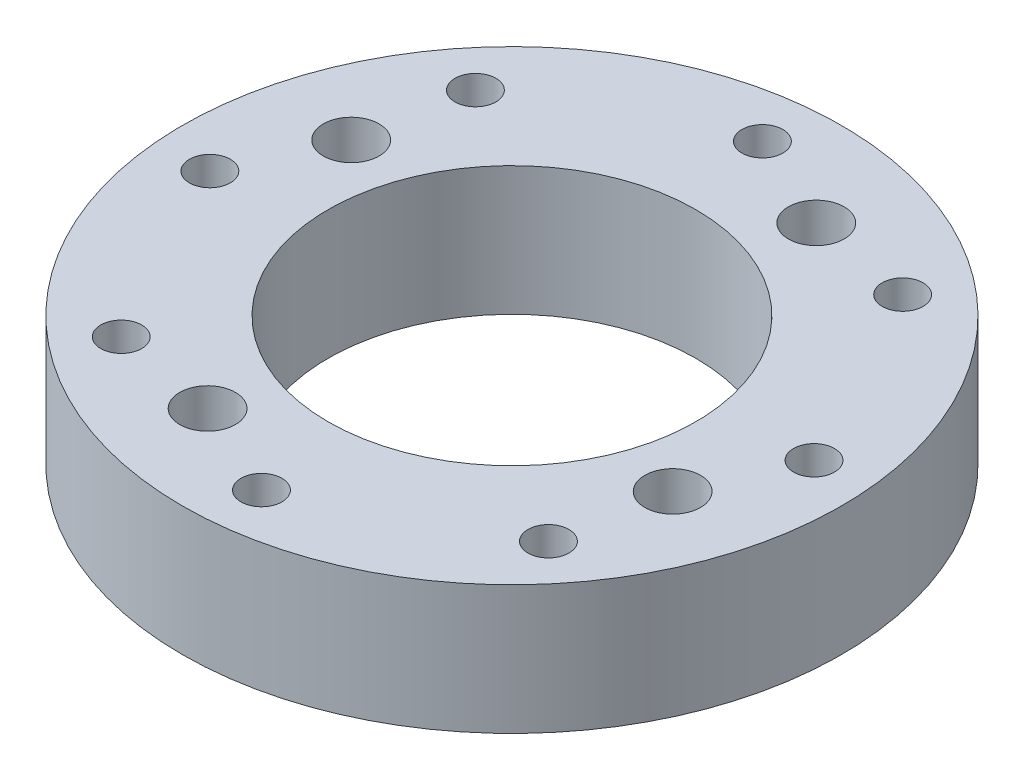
ISO-10303-21;
HEADER;
FILE_DESCRIPTION(('STEP AP214'),'2;1');
FILE_NAME('part.step','',(''),(''),'','','');
FILE_SCHEMA(('AUTOMOTIVE_DESIGN { 1 0 10303 214 1 1 1 1 }'));
ENDSEC;
DATA;
#1=APPLICATION_CONTEXT('core data for automotive mechanical design processes');
#2=APPLICATION_PROTOCOL_DEFINITION('international standard','automotive_design',2000,#1);
#3=PRODUCT_CONTEXT('',#1,'mechanical');
#4=PRODUCT('Part','Part','',(#3));
#5=PRODUCT_RELATED_PRODUCT_CATEGORY('part','',(#4));
#6=PRODUCT_DEFINITION_FORMATION('','',#4);
#7=PRODUCT_DEFINITION_CONTEXT('part definition',#1,'design');
#8=PRODUCT_DEFINITION('design','',#6,#7);
#9=PRODUCT_DEFINITION_SHAPE('','',#8);
#10=(LENGTH_UNIT() NAMED_UNIT(*) SI_UNIT(.MILLI.,.METRE.));
#11=(NAMED_UNIT(*) PLANE_ANGLE_UNIT() SI_UNIT($,.RADIAN.));
#12=(NAMED_UNIT(*) SI_UNIT($,.STERADIAN.) SOLID_ANGLE_UNIT());
#13=UNCERTAINTY_MEASURE_WITH_UNIT(LENGTH_MEASURE(1.E-05),#10,'distance_accuracy_value','');
#14=(GEOMETRIC_REPRESENTATION_CONTEXT(3) GLOBAL_UNCERTAINTY_ASSIGNED_CONTEXT((#13)) GLOBAL_UNIT_ASSIGNED_CONTEXT((#10,
#11,#12)) REPRESENTATION_CONTEXT('',''));
#15=CARTESIAN_POINT('',(0.,0.,0.));
#16=DIRECTION('',(0.,0.,1.));
#17=DIRECTION('',(1.,0.,0.));
#18=AXIS2_PLACEMENT_3D('',#15,#16,#17);
#19=CARTESIAN_POINT('',(0.,12.7,0.));
#20=DIRECTION('',(0.,1.,0.));
#21=DIRECTION('',(0.,0.,1.));
#22=AXIS2_PLACEMENT_3D('',#19,#20,#21);
#23=PLANE('',#22);
#24=CARTESIAN_POINT('',(21.0642430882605,12.7,17.4643657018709));
#25=DIRECTION('',(0.,-1.,0.));
#26=DIRECTION('',(0.,0.,-1.));
#27=AXIS2_PLACEMENT_3D('',#24,#25,#26);
#28=CIRCLE('',#27,2.0193);
#29=CARTESIAN_POINT('',(21.0642430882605,12.7,15.4450657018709));
#30=VERTEX_POINT('',#29);
#31=EDGE_CURVE('E142',#30,#30,#28,.T.);
#32=ORIENTED_EDGE('',*,*,#31,.T.);
#33=EDGE_LOOP('',(#32));
#34=FACE_BOUND('',#33,.T.);
#35=CARTESIAN_POINT('',(27.2438405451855,12.7,-2.54549771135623));
#36=DIRECTION('',(0.,-1.,0.));
#37=DIRECTION('',(0.,0.,-1.));
#38=AXIS2_PLACEMENT_3D('',#35,#36,#37);
#39=CIRCLE('',#38,2.0193);
#40=CARTESIAN_POINT('',(27.2438405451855,12.7,-4.56479771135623));
#41=VERTEX_POINT('',#40);
#42=EDGE_CURVE('E136',#41,#41,#39,.T.);
#43=ORIENTED_EDGE('',*,*,#42,.T.);
#44=EDGE_LOOP('',(#43));
#45=FACE_BOUND('',#44,.T.);
#46=CARTESIAN_POINT('',(17.4643657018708,12.7,-21.0642430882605));
#47=DIRECTION('',(0.,-1.,0.));
#48=DIRECTION('',(0.,0.,-1.));
#49=AXIS2_PLACEMENT_3D('',#46,#47,#48);
#50=CIRCLE('',#49,2.0193);
#51=CARTESIAN_POINT('',(17.4643657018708,12.7,-23.0835430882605));
#52=VERTEX_POINT('',#51);
#53=EDGE_CURVE('E130',#52,#52,#50,.T.);
#54=ORIENTED_EDGE('',*,*,#53,.T.);
#55=EDGE_LOOP('',(#54));
#56=FACE_BOUND('',#55,.T.);
#57=CARTESIAN_POINT('',(-2.54549771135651,12.7,-27.2438405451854));
#58=DIRECTION('',(0.,-1.,0.));
#59=DIRECTION('',(0.,0.,-1.));
#60=AXIS2_PLACEMENT_3D('',#57,#58,#59);
#61=CIRCLE('',#60,2.0193);
#62=CARTESIAN_POINT('',(-2.54549771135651,12.7,-29.2631405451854));
#63=VERTEX_POINT('',#62);
#64=EDGE_CURVE('E124',#63,#63,#61,.T.);
#65=ORIENTED_EDGE('',*,*,#64,.T.);
#66=EDGE_LOOP('',(#65));
#67=FACE_BOUND('',#66,.T.);
#68=CARTESIAN_POINT('',(-21.0642430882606,12.7,-17.4643657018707));
#69=DIRECTION('',(0.,-1.,0.));
#70=DIRECTION('',(0.,0.,-1.));
#71=AXIS2_PLACEMENT_3D('',#68,#69,#70);
#72=CIRCLE('',#71,2.0193);
#73=CARTESIAN_POINT('',(-21.0642430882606,12.7,-19.4836657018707));
#74=VERTEX_POINT('',#73);
#75=EDGE_CURVE('E118',#74,#74,#72,.T.);
#76=ORIENTED_EDGE('',*,*,#75,.T.);
#77=EDGE_LOOP('',(#76));
#78=FACE_BOUND('',#77,.T.);
#79=CARTESIAN_POINT('',(-27.2438405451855,12.7,2.54549771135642));
#80=DIRECTION('',(0.,-1.,0.));
#81=DIRECTION('',(0.,0.,-1.));
#82=AXIS2_PLACEMENT_3D('',#79,#80,#81);
#83=CIRCLE('',#82,2.0193);
#84=CARTESIAN_POINT('',(-27.2438405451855,12.7,0.526197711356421));
#85=VERTEX_POINT('',#84);
#86=EDGE_CURVE('E112',#85,#85,#83,.T.);
#87=ORIENTED_EDGE('',*,*,#86,.T.);
#88=EDGE_LOOP('',(#87));
#89=FACE_BOUND('',#88,.T.);
#90=CARTESIAN_POINT('',(-17.4643657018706,12.7,21.0642430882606));
#91=DIRECTION('',(0.,-1.,0.));
#92=DIRECTION('',(0.,0.,-1.));
#93=AXIS2_PLACEMENT_3D('',#90,#91,#92);
#94=CIRCLE('',#93,2.0193);
#95=CARTESIAN_POINT('',(-17.4643657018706,12.7,19.0449430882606));
#96=VERTEX_POINT('',#95);
#97=EDGE_CURVE('E106',#96,#96,#94,.T.);
#98=ORIENTED_EDGE('',*,*,#97,.T.);
#99=EDGE_LOOP('',(#98));
#100=FACE_BOUND('',#99,.T.);
#101=CARTESIAN_POINT('',(2.54549771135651,12.7,27.2438405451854));
#102=DIRECTION('',(0.,-1.,0.));
#103=DIRECTION('',(0.,0.,-1.));
#104=AXIS2_PLACEMENT_3D('',#101,#102,#103);
#105=CIRCLE('',#104,2.0193);
#106=CARTESIAN_POINT('',(2.54549771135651,12.7,25.2245405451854));
#107=VERTEX_POINT('',#106);
#108=EDGE_CURVE('E100',#107,#107,#105,.T.);
#109=ORIENTED_EDGE('',*,*,#108,.T.);
#110=EDGE_LOOP('',(#109));
#111=FACE_BOUND('',#110,.T.);
#112=CARTESIAN_POINT('',(22.9313664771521,12.7,7.08183814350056));
#113=DIRECTION('',(0.,-1.,0.));
#114=DIRECTION('',(0.,0.,-1.));
#115=AXIS2_PLACEMENT_3D('',#112,#113,#114);
#116=CIRCLE('',#115,2.75);
#117=CARTESIAN_POINT('',(22.9313664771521,12.7,4.33183814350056));
#118=VERTEX_POINT('',#117);
#119=EDGE_CURVE('E88',#118,#118,#116,.T.);
#120=ORIENTED_EDGE('',*,*,#119,.T.);
#121=EDGE_LOOP('',(#120));
#122=FACE_BOUND('',#121,.T.);
#123=CARTESIAN_POINT('',(7.08183814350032,12.7,-22.9313664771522));
#124=DIRECTION('',(0.,-1.,0.));
#125=DIRECTION('',(0.,0.,-1.));
#126=AXIS2_PLACEMENT_3D('',#123,#124,#125);
#127=CIRCLE('',#126,2.75);
#128=CARTESIAN_POINT('',(7.08183814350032,12.7,-25.6813664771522));
#129=VERTEX_POINT('',#128);
#130=EDGE_CURVE('E76',#129,#129,#127,.T.);
#131=ORIENTED_EDGE('',*,*,#130,.T.);
#132=EDGE_LOOP('',(#131));
#133=FACE_BOUND('',#132,.T.);
#134=CARTESIAN_POINT('',(-22.9313664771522,12.7,-7.0818381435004));
#135=DIRECTION('',(0.,-1.,0.));
#136=DIRECTION('',(0.,0.,-1.));
#137=AXIS2_PLACEMENT_3D('',#134,#135,#136);
#138=CIRCLE('',#137,2.75);
#139=CARTESIAN_POINT('',(-22.9313664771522,12.7,-9.83183814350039));
#140=VERTEX_POINT('',#139);
#141=EDGE_CURVE('E64',#140,#140,#138,.T.);
#142=ORIENTED_EDGE('',*,*,#141,.T.);
#143=EDGE_LOOP('',(#142));
#144=FACE_BOUND('',#143,.T.);
#145=CARTESIAN_POINT('',(-7.08183814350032,12.7,22.9313664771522));
#146=DIRECTION('',(0.,-1.,0.));
#147=DIRECTION('',(0.,0.,-1.));
#148=AXIS2_PLACEMENT_3D('',#145,#146,#147);
#149=CIRCLE('',#148,2.75);
#150=CARTESIAN_POINT('',(-7.08183814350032,12.7,20.1813664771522));
#151=VERTEX_POINT('',#150);
#152=EDGE_CURVE('E50',#151,#151,#149,.T.);
#153=ORIENTED_EDGE('',*,*,#152,.T.);
#154=EDGE_LOOP('',(#153));
#155=FACE_BOUND('',#154,.T.);
#156=CARTESIAN_POINT('',(0.,12.7,0.));
#157=DIRECTION('',(0.,1.,0.));
#158=DIRECTION('',(0.,0.,1.));
#159=AXIS2_PLACEMENT_3D('',#156,#157,#158);
#160=CIRCLE('',#159,32.5);
#161=CARTESIAN_POINT('',(0.,12.7,32.5));
#162=VERTEX_POINT('',#161);
#163=EDGE_CURVE('E10',#162,#162,#160,.T.);
#164=ORIENTED_EDGE('',*,*,#163,.T.);
#165=EDGE_LOOP('',(#164));
#166=FACE_BOUND('',#165,.T.);
#167=CARTESIAN_POINT('',(0.,12.7,0.));
#168=DIRECTION('',(0.,1.,0.));
#169=DIRECTION('',(0.,0.,1.));
#170=AXIS2_PLACEMENT_3D('',#167,#168,#169);
#171=CIRCLE('',#170,18.127);
#172=CARTESIAN_POINT('',(0.,12.7,18.127));
#173=VERTEX_POINT('',#172);
#174=EDGE_CURVE('E45',#173,#173,#171,.T.);
#175=ORIENTED_EDGE('',*,*,#174,.F.);
#176=EDGE_LOOP('',(#175));
#177=FACE_BOUND('',#176,.T.);
#178=ADVANCED_FACE('F34',(#34,#45,#56,#67,#78,#89,#100,#111,#122,#133,#144,#155,#166,#177),#23,.T.);
#179=CARTESIAN_POINT('',(0.,0.,0.));
#180=DIRECTION('',(0.,1.,0.));
#181=DIRECTION('',(0.,0.,1.));
#182=AXIS2_PLACEMENT_3D('',#179,#180,#181);
#183=PLANE('',#182);
#184=CARTESIAN_POINT('',(21.0642430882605,0.,17.4643657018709));
#185=DIRECTION('',(0.,-1.,0.));
#186=DIRECTION('',(0.,0.,-1.));
#187=AXIS2_PLACEMENT_3D('',#184,#185,#186);
#188=CIRCLE('',#187,2.01929999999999);
#189=CARTESIAN_POINT('',(21.0642430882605,0.,15.4450657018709));
#190=VERTEX_POINT('',#189);
#191=EDGE_CURVE('E145',#190,#190,#188,.T.);
#192=ORIENTED_EDGE('',*,*,#191,.F.);
#193=EDGE_LOOP('',(#192));
#194=FACE_BOUND('',#193,.T.);
#195=CARTESIAN_POINT('',(27.2438405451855,0.,-2.54549771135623));
#196=DIRECTION('',(0.,-1.,0.));
#197=DIRECTION('',(0.,0.,-1.));
#198=AXIS2_PLACEMENT_3D('',#195,#196,#197);
#199=CIRCLE('',#198,2.01929999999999);
#200=CARTESIAN_POINT('',(27.2438405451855,0.,-4.56479771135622));
#201=VERTEX_POINT('',#200);
#202=EDGE_CURVE('E139',#201,#201,#199,.T.);
#203=ORIENTED_EDGE('',*,*,#202,.F.);
#204=EDGE_LOOP('',(#203));
#205=FACE_BOUND('',#204,.T.);
#206=CARTESIAN_POINT('',(17.4643657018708,0.,-21.0642430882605));
#207=DIRECTION('',(0.,-1.,0.));
#208=DIRECTION('',(0.,0.,-1.));
#209=AXIS2_PLACEMENT_3D('',#206,#207,#208);
#210=CIRCLE('',#209,2.01929999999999);
#211=CARTESIAN_POINT('',(17.4643657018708,0.,-23.0835430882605));
#212=VERTEX_POINT('',#211);
#213=EDGE_CURVE('E133',#212,#212,#210,.T.);
#214=ORIENTED_EDGE('',*,*,#213,.F.);
#215=EDGE_LOOP('',(#214));
#216=FACE_BOUND('',#215,.T.);
#217=CARTESIAN_POINT('',(-2.54549771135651,0.,-27.2438405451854));
#218=DIRECTION('',(0.,-1.,0.));
#219=DIRECTION('',(0.,0.,-1.));
#220=AXIS2_PLACEMENT_3D('',#217,#218,#219);
#221=CIRCLE('',#220,2.01929999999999);
#222=CARTESIAN_POINT('',(-2.54549771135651,0.,-29.2631405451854));
#223=VERTEX_POINT('',#222);
#224=EDGE_CURVE('E127',#223,#223,#221,.T.);
#225=ORIENTED_EDGE('',*,*,#224,.F.);
#226=EDGE_LOOP('',(#225));
#227=FACE_BOUND('',#226,.T.);
#228=CARTESIAN_POINT('',(-21.0642430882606,0.,-17.4643657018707));
#229=DIRECTION('',(0.,-1.,0.));
#230=DIRECTION('',(0.,0.,-1.));
#231=AXIS2_PLACEMENT_3D('',#228,#229,#230);
#232=CIRCLE('',#231,2.01929999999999);
#233=CARTESIAN_POINT('',(-21.0642430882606,0.,-19.4836657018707));
#234=VERTEX_POINT('',#233);
#235=EDGE_CURVE('E121',#234,#234,#232,.T.);
#236=ORIENTED_EDGE('',*,*,#235,.F.);
#237=EDGE_LOOP('',(#236));
#238=FACE_BOUND('',#237,.T.);
#239=CARTESIAN_POINT('',(-27.2438405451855,0.,2.54549771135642));
#240=DIRECTION('',(0.,-1.,0.));
#241=DIRECTION('',(0.,0.,-1.));
#242=AXIS2_PLACEMENT_3D('',#239,#240,#241);
#243=CIRCLE('',#242,2.01929999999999);
#244=CARTESIAN_POINT('',(-27.2438405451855,0.,0.526197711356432));
#245=VERTEX_POINT('',#244);
#246=EDGE_CURVE('E115',#245,#245,#243,.T.);
#247=ORIENTED_EDGE('',*,*,#246,.F.);
#248=EDGE_LOOP('',(#247));
#249=FACE_BOUND('',#248,.T.);
#250=CARTESIAN_POINT('',(-17.4643657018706,0.,21.0642430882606));
#251=DIRECTION('',(0.,-1.,0.));
#252=DIRECTION('',(0.,0.,-1.));
#253=AXIS2_PLACEMENT_3D('',#250,#251,#252);
#254=CIRCLE('',#253,2.01929999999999);
#255=CARTESIAN_POINT('',(-17.4643657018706,0.,19.0449430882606));
#256=VERTEX_POINT('',#255);
#257=EDGE_CURVE('E109',#256,#256,#254,.T.);
#258=ORIENTED_EDGE('',*,*,#257,.F.);
#259=EDGE_LOOP('',(#258));
#260=FACE_BOUND('',#259,.T.);
#261=CARTESIAN_POINT('',(2.54549771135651,0.,27.2438405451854));
#262=DIRECTION('',(0.,-1.,0.));
#263=DIRECTION('',(0.,0.,-1.));
#264=AXIS2_PLACEMENT_3D('',#261,#262,#263);
#265=CIRCLE('',#264,2.01929999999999);
#266=CARTESIAN_POINT('',(2.54549771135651,0.,25.2245405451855));
#267=VERTEX_POINT('',#266);
#268=EDGE_CURVE('E103',#267,#267,#265,.T.);
#269=ORIENTED_EDGE('',*,*,#268,.F.);
#270=EDGE_LOOP('',(#269));
#271=FACE_BOUND('',#270,.T.);
#272=CARTESIAN_POINT('',(22.9313664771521,0.,7.08183814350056));
#273=DIRECTION('',(0.,-1.,0.));
#274=DIRECTION('',(0.,0.,-1.));
#275=AXIS2_PLACEMENT_3D('',#272,#273,#274);
#276=CIRCLE('',#275,5.);
#277=CARTESIAN_POINT('',(22.9313664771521,0.,2.08183814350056));
#278=VERTEX_POINT('',#277);
#279=EDGE_CURVE('E97',#278,#278,#276,.T.);
#280=ORIENTED_EDGE('',*,*,#279,.F.);
#281=EDGE_LOOP('',(#280));
#282=FACE_BOUND('',#281,.T.);
#283=CARTESIAN_POINT('',(7.08183814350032,0.,-22.9313664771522));
#284=DIRECTION('',(0.,-1.,0.));
#285=DIRECTION('',(0.,0.,-1.));
#286=AXIS2_PLACEMENT_3D('',#283,#284,#285);
#287=CIRCLE('',#286,5.);
#288=CARTESIAN_POINT('',(7.08183814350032,0.,-27.9313664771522));
#289=VERTEX_POINT('',#288);
#290=EDGE_CURVE('E85',#289,#289,#287,.T.);
#291=ORIENTED_EDGE('',*,*,#290,.F.);
#292=EDGE_LOOP('',(#291));
#293=FACE_BOUND('',#292,.T.);
#294=CARTESIAN_POINT('',(-22.9313664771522,0.,-7.0818381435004));
#295=DIRECTION('',(0.,-1.,0.));
#296=DIRECTION('',(0.,0.,-1.));
#297=AXIS2_PLACEMENT_3D('',#294,#295,#296);
#298=CIRCLE('',#297,5.);
#299=CARTESIAN_POINT('',(-22.9313664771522,0.,-12.0818381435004));
#300=VERTEX_POINT('',#299);
#301=EDGE_CURVE('E73',#300,#300,#298,.T.);
#302=ORIENTED_EDGE('',*,*,#301,.F.);
#303=EDGE_LOOP('',(#302));
#304=FACE_BOUND('',#303,.T.);
#305=CARTESIAN_POINT('',(-7.08183814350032,0.,22.9313664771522));
#306=DIRECTION('',(0.,-1.,0.));
#307=DIRECTION('',(0.,0.,-1.));
#308=AXIS2_PLACEMENT_3D('',#305,#306,#307);
#309=CIRCLE('',#308,5.);
#310=CARTESIAN_POINT('',(-7.08183814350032,0.,17.9313664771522));
#311=VERTEX_POINT('',#310);
#312=EDGE_CURVE('E61',#311,#311,#309,.T.);
#313=ORIENTED_EDGE('',*,*,#312,.F.);
#314=EDGE_LOOP('',(#313));
#315=FACE_BOUND('',#314,.T.);
#316=CARTESIAN_POINT('',(0.,0.,0.));
#317=DIRECTION('',(0.,1.,0.));
#318=DIRECTION('',(0.,0.,1.));
#319=AXIS2_PLACEMENT_3D('',#316,#317,#318);
#320=CIRCLE('',#319,32.5);
#321=CARTESIAN_POINT('',(0.,0.,32.5));
#322=VERTEX_POINT('',#321);
#323=EDGE_CURVE('E38',#322,#322,#320,.T.);
#324=ORIENTED_EDGE('',*,*,#323,.F.);
#325=EDGE_LOOP('',(#324));
#326=FACE_BOUND('',#325,.T.);
#327=CARTESIAN_POINT('',(0.,0.,0.));
#328=DIRECTION('',(0.,1.,0.));
#329=DIRECTION('',(0.,0.,1.));
#330=AXIS2_PLACEMENT_3D('',#327,#328,#329);
#331=CIRCLE('',#330,18.127);
#332=CARTESIAN_POINT('',(0.,0.,18.127));
#333=VERTEX_POINT('',#332);
#334=EDGE_CURVE('E47',#333,#333,#331,.T.);
#335=ORIENTED_EDGE('',*,*,#334,.T.);
#336=EDGE_LOOP('',(#335));
#337=FACE_BOUND('',#336,.T.);
#338=ADVANCED_FACE('F151',(#194,#205,#216,#227,#238,#249,#260,#271,#282,#293,#304,#315,#326,
#337),#183,.F.);
#339=CARTESIAN_POINT('',(0.,12.7,0.));
#340=DIRECTION('',(0.,-1.,0.));
#341=DIRECTION('',(0.,0.,-1.));
#342=AXIS2_PLACEMENT_3D('',#339,#340,#341);
#343=CYLINDRICAL_SURFACE('',#342,32.5);
#344=ORIENTED_EDGE('',*,*,#163,.F.);
#345=EDGE_LOOP('',(#344));
#346=FACE_BOUND('',#345,.T.);
#347=ORIENTED_EDGE('',*,*,#323,.T.);
#348=EDGE_LOOP('',(#347));
#349=FACE_BOUND('',#348,.T.);
#350=ADVANCED_FACE('F36',(#346,#349),#343,.T.);
#351=CARTESIAN_POINT('',(0.,12.7,0.));
#352=DIRECTION('',(0.,-1.,0.));
#353=DIRECTION('',(0.,0.,-1.));
#354=AXIS2_PLACEMENT_3D('',#351,#352,#353);
#355=CYLINDRICAL_SURFACE('',#354,18.127);
#356=ORIENTED_EDGE('',*,*,#174,.T.);
#357=EDGE_LOOP('',(#356));
#358=FACE_BOUND('',#357,.T.);
#359=ORIENTED_EDGE('',*,*,#334,.F.);
#360=EDGE_LOOP('',(#359));
#361=FACE_BOUND('',#360,.T.);
#362=ADVANCED_FACE('F180',(#358,#361),#355,.F.);
#363=CARTESIAN_POINT('',(-7.08183814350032,0.,22.9313664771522));
#364=DIRECTION('',(0.,-1.,0.));
#365=DIRECTION('',(0.,0.,-1.));
#366=AXIS2_PLACEMENT_3D('',#363,#364,#365);
#367=CYLINDRICAL_SURFACE('',#366,2.75);
#368=ORIENTED_EDGE('',*,*,#152,.F.);
#369=EDGE_LOOP('',(#368));
#370=FACE_BOUND('',#369,.T.);
#371=CARTESIAN_POINT('',(-7.08183814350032,6.778,22.9313664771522));
#372=DIRECTION('',(0.,-1.,0.));
#373=DIRECTION('',(0.,0.,-1.));
#374=AXIS2_PLACEMENT_3D('',#371,#372,#373);
#375=CIRCLE('',#374,2.75);
#376=CARTESIAN_POINT('',(-7.08183814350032,6.778,20.1813664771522));
#377=VERTEX_POINT('',#376);
#378=EDGE_CURVE('E55',#377,#377,#375,.T.);
#379=ORIENTED_EDGE('',*,*,#378,.T.);
#380=EDGE_LOOP('',(#379));
#381=FACE_BOUND('',#380,.T.);
#382=ADVANCED_FACE('F182',(#370,#381),#367,.F.);
#383=CARTESIAN_POINT('',(-4.33183814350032,6.778,22.9313664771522));
#384=DIRECTION('',(0.,1.,0.));
#385=DIRECTION('',(0.,0.,1.));
#386=AXIS2_PLACEMENT_3D('',#383,#384,#385);
#387=PLANE('',#386);
#388=ORIENTED_EDGE('',*,*,#378,.F.);
#389=EDGE_LOOP('',(#388));
#390=FACE_BOUND('',#389,.T.);
#391=CARTESIAN_POINT('',(-7.08183814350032,6.778,22.9313664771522));
#392=DIRECTION('',(0.,-1.,0.));
#393=DIRECTION('',(0.,0.,-1.));
#394=AXIS2_PLACEMENT_3D('',#391,#392,#393);
#395=CIRCLE('',#394,5.);
#396=CARTESIAN_POINT('',(-7.08183814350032,6.778,17.9313664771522));
#397=VERTEX_POINT('',#396);
#398=EDGE_CURVE('E58',#397,#397,#395,.T.);
#399=ORIENTED_EDGE('',*,*,#398,.T.);
#400=EDGE_LOOP('',(#399));
#401=FACE_BOUND('',#400,.T.);
#402=ADVANCED_FACE('F189',(#390,#401),#387,.F.);
#403=CARTESIAN_POINT('',(-7.08183814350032,0.,22.9313664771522));
#404=DIRECTION('',(0.,-1.,0.));
#405=DIRECTION('',(0.,0.,-1.));
#406=AXIS2_PLACEMENT_3D('',#403,#404,#405);
#407=CYLINDRICAL_SURFACE('',#406,5.);
#408=ORIENTED_EDGE('',*,*,#398,.F.);
#409=EDGE_LOOP('',(#408));
#410=FACE_BOUND('',#409,.T.);
#411=ORIENTED_EDGE('',*,*,#312,.T.);
#412=EDGE_LOOP('',(#411));
#413=FACE_BOUND('',#412,.T.);
#414=ADVANCED_FACE('F228',(#410,#413),#407,.F.);
#415=CARTESIAN_POINT('',(-22.9313664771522,0.,-7.0818381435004));
#416=DIRECTION('',(0.,-1.,0.));
#417=DIRECTION('',(0.,0.,-1.));
#418=AXIS2_PLACEMENT_3D('',#415,#416,#417);
#419=CYLINDRICAL_SURFACE('',#418,2.75);
#420=ORIENTED_EDGE('',*,*,#141,.F.);
#421=EDGE_LOOP('',(#420));
#422=FACE_BOUND('',#421,.T.);
#423=CARTESIAN_POINT('',(-22.9313664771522,6.778,-7.0818381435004));
#424=DIRECTION('',(0.,-1.,0.));
#425=DIRECTION('',(0.,0.,-1.));
#426=AXIS2_PLACEMENT_3D('',#423,#424,#425);
#427=CIRCLE('',#426,2.75);
#428=CARTESIAN_POINT('',(-22.9313664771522,6.778,-9.83183814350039));
#429=VERTEX_POINT('',#428);
#430=EDGE_CURVE('E67',#429,#429,#427,.T.);
#431=ORIENTED_EDGE('',*,*,#430,.T.);
#432=EDGE_LOOP('',(#431));
#433=FACE_BOUND('',#432,.T.);
#434=ADVANCED_FACE('F234',(#422,#433),#419,.F.);
#435=CARTESIAN_POINT('',(-20.1813664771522,6.778,-7.0818381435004));
#436=DIRECTION('',(0.,1.,0.));
#437=DIRECTION('',(0.,0.,1.));
#438=AXIS2_PLACEMENT_3D('',#435,#436,#437);
#439=PLANE('',#438);
#440=ORIENTED_EDGE('',*,*,#430,.F.);
#441=EDGE_LOOP('',(#440));
#442=FACE_BOUND('',#441,.T.);
#443=CARTESIAN_POINT('',(-22.9313664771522,6.778,-7.0818381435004));
#444=DIRECTION('',(0.,-1.,0.));
#445=DIRECTION('',(0.,0.,-1.));
#446=AXIS2_PLACEMENT_3D('',#443,#444,#445);
#447=CIRCLE('',#446,5.);
#448=CARTESIAN_POINT('',(-22.9313664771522,6.778,-12.0818381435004));
#449=VERTEX_POINT('',#448);
#450=EDGE_CURVE('E70',#449,#449,#447,.T.);
#451=ORIENTED_EDGE('',*,*,#450,.T.);
#452=EDGE_LOOP('',(#451));
#453=FACE_BOUND('',#452,.T.);
#454=ADVANCED_FACE('F239',(#442,#453),#439,.F.);
#455=CARTESIAN_POINT('',(-22.9313664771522,0.,-7.0818381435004));
#456=DIRECTION('',(0.,-1.,0.));
#457=DIRECTION('',(0.,0.,-1.));
#458=AXIS2_PLACEMENT_3D('',#455,#456,#457);
#459=CYLINDRICAL_SURFACE('',#458,5.);
#460=ORIENTED_EDGE('',*,*,#450,.F.);
#461=EDGE_LOOP('',(#460));
#462=FACE_BOUND('',#461,.T.);
#463=ORIENTED_EDGE('',*,*,#301,.T.);
#464=EDGE_LOOP('',(#463));
#465=FACE_BOUND('',#464,.T.);
#466=ADVANCED_FACE('F245',(#462,#465),#459,.F.);
#467=CARTESIAN_POINT('',(7.08183814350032,0.,-22.9313664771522));
#468=DIRECTION('',(0.,-1.,0.));
#469=DIRECTION('',(0.,0.,-1.));
#470=AXIS2_PLACEMENT_3D('',#467,#468,#469);
#471=CYLINDRICAL_SURFACE('',#470,2.75);
#472=ORIENTED_EDGE('',*,*,#130,.F.);
#473=EDGE_LOOP('',(#472));
#474=FACE_BOUND('',#473,.T.);
#475=CARTESIAN_POINT('',(7.08183814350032,6.778,-22.9313664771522));
#476=DIRECTION('',(0.,-1.,0.));
#477=DIRECTION('',(0.,0.,-1.));
#478=AXIS2_PLACEMENT_3D('',#475,#476,#477);
#479=CIRCLE('',#478,2.75);
#480=CARTESIAN_POINT('',(7.08183814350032,6.778,-25.6813664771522));
#481=VERTEX_POINT('',#480);
#482=EDGE_CURVE('E79',#481,#481,#479,.T.);
#483=ORIENTED_EDGE('',*,*,#482,.T.);
#484=EDGE_LOOP('',(#483));
#485=FACE_BOUND('',#484,.T.);
#486=ADVANCED_FACE('F249',(#474,#485),#471,.F.);
#487=CARTESIAN_POINT('',(9.83183814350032,6.778,-22.9313664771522));
#488=DIRECTION('',(0.,1.,0.));
#489=DIRECTION('',(0.,0.,1.));
#490=AXIS2_PLACEMENT_3D('',#487,#488,#489);
#491=PLANE('',#490);
#492=ORIENTED_EDGE('',*,*,#482,.F.);
#493=EDGE_LOOP('',(#492));
#494=FACE_BOUND('',#493,.T.);
#495=CARTESIAN_POINT('',(7.08183814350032,6.778,-22.9313664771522));
#496=DIRECTION('',(0.,-1.,0.));
#497=DIRECTION('',(0.,0.,-1.));
#498=AXIS2_PLACEMENT_3D('',#495,#496,#497);
#499=CIRCLE('',#498,5.);
#500=CARTESIAN_POINT('',(7.08183814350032,6.778,-27.9313664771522));
#501=VERTEX_POINT('',#500);
#502=EDGE_CURVE('E82',#501,#501,#499,.T.);
#503=ORIENTED_EDGE('',*,*,#502,.T.);
#504=EDGE_LOOP('',(#503));
#505=FACE_BOUND('',#504,.T.);
#506=ADVANCED_FACE('F253',(#494,#505),#491,.F.);
#507=CARTESIAN_POINT('',(7.08183814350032,0.,-22.9313664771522));
#508=DIRECTION('',(0.,-1.,0.));
#509=DIRECTION('',(0.,0.,-1.));
#510=AXIS2_PLACEMENT_3D('',#507,#508,#509);
#511=CYLINDRICAL_SURFACE('',#510,5.);
#512=ORIENTED_EDGE('',*,*,#502,.F.);
#513=EDGE_LOOP('',(#512));
#514=FACE_BOUND('',#513,.T.);
#515=ORIENTED_EDGE('',*,*,#290,.T.);
#516=EDGE_LOOP('',(#515));
#517=FACE_BOUND('',#516,.T.);
#518=ADVANCED_FACE('F257',(#514,#517),#511,.F.);
#519=CARTESIAN_POINT('',(22.9313664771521,0.,7.08183814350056));
#520=DIRECTION('',(0.,-1.,0.));
#521=DIRECTION('',(0.,0.,-1.));
#522=AXIS2_PLACEMENT_3D('',#519,#520,#521);
#523=CYLINDRICAL_SURFACE('',#522,2.75);
#524=ORIENTED_EDGE('',*,*,#119,.F.);
#525=EDGE_LOOP('',(#524));
#526=FACE_BOUND('',#525,.T.);
#527=CARTESIAN_POINT('',(22.9313664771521,6.778,7.08183814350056));
#528=DIRECTION('',(0.,-1.,0.));
#529=DIRECTION('',(0.,0.,-1.));
#530=AXIS2_PLACEMENT_3D('',#527,#528,#529);
#531=CIRCLE('',#530,2.75);
#532=CARTESIAN_POINT('',(22.9313664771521,6.778,4.33183814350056));
#533=VERTEX_POINT('',#532);
#534=EDGE_CURVE('E91',#533,#533,#531,.T.);
#535=ORIENTED_EDGE('',*,*,#534,.T.);
#536=EDGE_LOOP('',(#535));
#537=FACE_BOUND('',#536,.T.);
#538=ADVANCED_FACE('F261',(#526,#537),#523,.F.);
#539=CARTESIAN_POINT('',(25.6813664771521,6.778,7.08183814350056));
#540=DIRECTION('',(0.,1.,0.));
#541=DIRECTION('',(0.,0.,1.));
#542=AXIS2_PLACEMENT_3D('',#539,#540,#541);
#543=PLANE('',#542);
#544=ORIENTED_EDGE('',*,*,#534,.F.);
#545=EDGE_LOOP('',(#544));
#546=FACE_BOUND('',#545,.T.);
#547=CARTESIAN_POINT('',(22.9313664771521,6.778,7.08183814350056));
#548=DIRECTION('',(0.,-1.,0.));
#549=DIRECTION('',(0.,0.,-1.));
#550=AXIS2_PLACEMENT_3D('',#547,#548,#549);
#551=CIRCLE('',#550,5.);
#552=CARTESIAN_POINT('',(22.9313664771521,6.778,2.08183814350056));
#553=VERTEX_POINT('',#552);
#554=EDGE_CURVE('E94',#553,#553,#551,.T.);
#555=ORIENTED_EDGE('',*,*,#554,.T.);
#556=EDGE_LOOP('',(#555));
#557=FACE_BOUND('',#556,.T.);
#558=ADVANCED_FACE('F265',(#546,#557),#543,.F.);
#559=CARTESIAN_POINT('',(22.9313664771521,0.,7.08183814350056));
#560=DIRECTION('',(0.,-1.,0.));
#561=DIRECTION('',(0.,0.,-1.));
#562=AXIS2_PLACEMENT_3D('',#559,#560,#561);
#563=CYLINDRICAL_SURFACE('',#562,5.);
#564=ORIENTED_EDGE('',*,*,#554,.F.);
#565=EDGE_LOOP('',(#564));
#566=FACE_BOUND('',#565,.T.);
#567=ORIENTED_EDGE('',*,*,#279,.T.);
#568=EDGE_LOOP('',(#567));
#569=FACE_BOUND('',#568,.T.);
#570=ADVANCED_FACE('F269',(#566,#569),#563,.F.);
#571=CARTESIAN_POINT('',(2.54549771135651,0.,27.2438405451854));
#572=DIRECTION('',(0.,-1.,0.));
#573=DIRECTION('',(0.,0.,-1.));
#574=AXIS2_PLACEMENT_3D('',#571,#572,#573);
#575=CYLINDRICAL_SURFACE('',#574,2.01929999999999);
#576=ORIENTED_EDGE('',*,*,#108,.F.);
#577=EDGE_LOOP('',(#576));
#578=FACE_BOUND('',#577,.T.);
#579=ORIENTED_EDGE('',*,*,#268,.T.);
#580=EDGE_LOOP('',(#579));
#581=FACE_BOUND('',#580,.T.);
#582=ADVANCED_FACE('F273',(#578,#581),#575,.F.);
#583=CARTESIAN_POINT('',(-17.4643657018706,0.,21.0642430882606));
#584=DIRECTION('',(0.,-1.,0.));
#585=DIRECTION('',(0.,0.,-1.));
#586=AXIS2_PLACEMENT_3D('',#583,#584,#585);
#587=CYLINDRICAL_SURFACE('',#586,2.01929999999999);
#588=ORIENTED_EDGE('',*,*,#97,.F.);
#589=EDGE_LOOP('',(#588));
#590=FACE_BOUND('',#589,.T.);
#591=ORIENTED_EDGE('',*,*,#257,.T.);
#592=EDGE_LOOP('',(#591));
#593=FACE_BOUND('',#592,.T.);
#594=ADVANCED_FACE('F277',(#590,#593),#587,.F.);
#595=CARTESIAN_POINT('',(-27.2438405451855,0.,2.54549771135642));
#596=DIRECTION('',(0.,-1.,0.));
#597=DIRECTION('',(0.,0.,-1.));
#598=AXIS2_PLACEMENT_3D('',#595,#596,#597);
#599=CYLINDRICAL_SURFACE('',#598,2.01929999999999);
#600=ORIENTED_EDGE('',*,*,#86,.F.);
#601=EDGE_LOOP('',(#600));
#602=FACE_BOUND('',#601,.T.);
#603=ORIENTED_EDGE('',*,*,#246,.T.);
#604=EDGE_LOOP('',(#603));
#605=FACE_BOUND('',#604,.T.);
#606=ADVANCED_FACE('F281',(#602,#605),#599,.F.);
#607=CARTESIAN_POINT('',(-21.0642430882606,0.,-17.4643657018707));
#608=DIRECTION('',(0.,-1.,0.));
#609=DIRECTION('',(0.,0.,-1.));
#610=AXIS2_PLACEMENT_3D('',#607,#608,#609);
#611=CYLINDRICAL_SURFACE('',#610,2.01929999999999);
#612=ORIENTED_EDGE('',*,*,#75,.F.);
#613=EDGE_LOOP('',(#612));
#614=FACE_BOUND('',#613,.T.);
#615=ORIENTED_EDGE('',*,*,#235,.T.);
#616=EDGE_LOOP('',(#615));
#617=FACE_BOUND('',#616,.T.);
#618=ADVANCED_FACE('F285',(#614,#617),#611,.F.);
#619=CARTESIAN_POINT('',(-2.54549771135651,0.,-27.2438405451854));
#620=DIRECTION('',(0.,-1.,0.));
#621=DIRECTION('',(0.,0.,-1.));
#622=AXIS2_PLACEMENT_3D('',#619,#620,#621);
#623=CYLINDRICAL_SURFACE('',#622,2.01929999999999);
#624=ORIENTED_EDGE('',*,*,#64,.F.);
#625=EDGE_LOOP('',(#624));
#626=FACE_BOUND('',#625,.T.);
#627=ORIENTED_EDGE('',*,*,#224,.T.);
#628=EDGE_LOOP('',(#627));
#629=FACE_BOUND('',#628,.T.);
#630=ADVANCED_FACE('F289',(#626,#629),#623,.F.);
#631=CARTESIAN_POINT('',(17.4643657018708,0.,-21.0642430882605));
#632=DIRECTION('',(0.,-1.,0.));
#633=DIRECTION('',(0.,0.,-1.));
#634=AXIS2_PLACEMENT_3D('',#631,#632,#633);
#635=CYLINDRICAL_SURFACE('',#634,2.01929999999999);
#636=ORIENTED_EDGE('',*,*,#53,.F.);
#637=EDGE_LOOP('',(#636));
#638=FACE_BOUND('',#637,.T.);
#639=ORIENTED_EDGE('',*,*,#213,.T.);
#640=EDGE_LOOP('',(#639));
#641=FACE_BOUND('',#640,.T.);
#642=ADVANCED_FACE('F293',(#638,#641),#635,.F.);
#643=CARTESIAN_POINT('',(27.2438405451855,0.,-2.54549771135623));
#644=DIRECTION('',(0.,-1.,0.));
#645=DIRECTION('',(0.,0.,-1.));
#646=AXIS2_PLACEMENT_3D('',#643,#644,#645);
#647=CYLINDRICAL_SURFACE('',#646,2.01929999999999);
#648=ORIENTED_EDGE('',*,*,#42,.F.);
#649=EDGE_LOOP('',(#648));
#650=FACE_BOUND('',#649,.T.);
#651=ORIENTED_EDGE('',*,*,#202,.T.);
#652=EDGE_LOOP('',(#651));
#653=FACE_BOUND('',#652,.T.);
#654=ADVANCED_FACE('F297',(#650,#653),#647,.F.);
#655=CARTESIAN_POINT('',(21.0642430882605,0.,17.4643657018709));
#656=DIRECTION('',(0.,-1.,0.));
#657=DIRECTION('',(0.,0.,-1.));
#658=AXIS2_PLACEMENT_3D('',#655,#656,#657);
#659=CYLINDRICAL_SURFACE('',#658,2.01929999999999);
#660=ORIENTED_EDGE('',*,*,#31,.F.);
#661=EDGE_LOOP('',(#660));
#662=FACE_BOUND('',#661,.T.);
#663=ORIENTED_EDGE('',*,*,#191,.T.);
#664=EDGE_LOOP('',(#663));
#665=FACE_BOUND('',#664,.T.);
#666=ADVANCED_FACE('F149',(#662,#665),#659,.F.);
#667=CLOSED_SHELL('',(#178,#338,#350,#362,#382,#402,#414,#434,#454,#466,#486,#506,#518,#538,
#558,#570,#582,#594,#606,#618,#630,#642,#654,#666));
#668=MANIFOLD_SOLID_BREP('B2',#667);
#669=ADVANCED_BREP_SHAPE_REPRESENTATION('',(#18,#668),#14);
#670=SHAPE_DEFINITION_REPRESENTATION(#9,#669);
ENDSEC;
END-ISO-10303-21;
